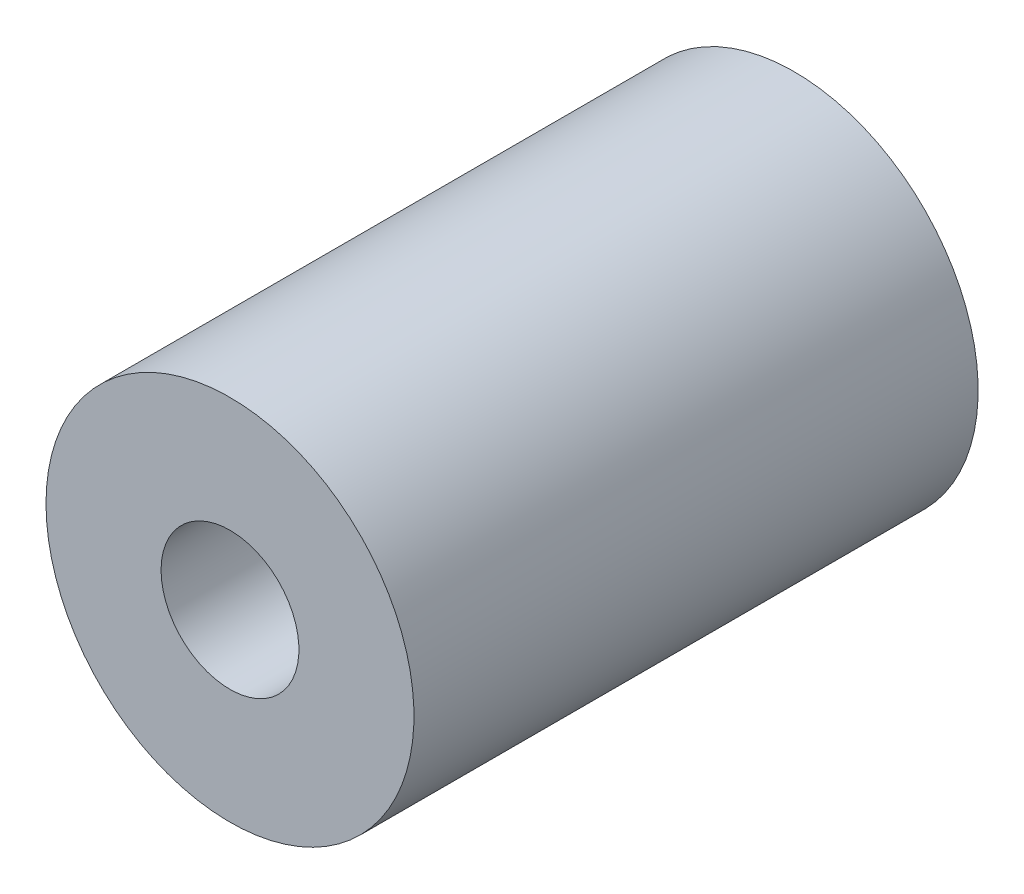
from build123d import *

# Parameters (mm, degrees)
SKETCH1_R      = 9.525
SKETCH1_R_2    = 3.5687
EXTRUDE1_DEPTH = 29.21


with BuildPart() as part:
    # Sketch1 → Extrude1 (new body)
    with BuildSketch(Plane.XY):
        with Locations(Location((0, 0, 0), (0, 0, 180))):
            Circle(SKETCH1_R)
        with Locations(Location((0, 0, 0), (0, 0, 180))):
            Circle(SKETCH1_R_2, mode=Mode.SUBTRACT)
    extrude(amount=EXTRUDE1_DEPTH)


solid = part.part
